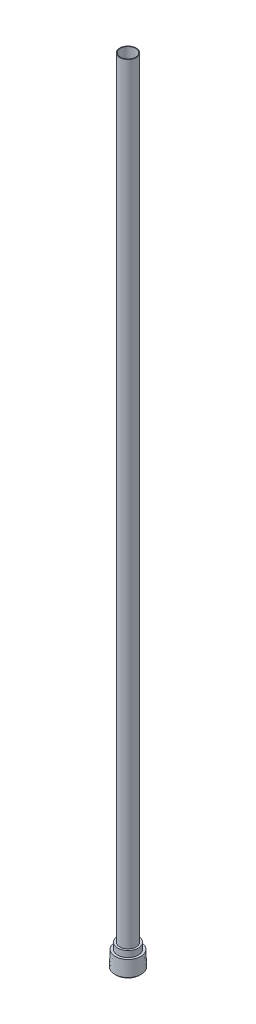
ISO-10303-21;
HEADER;
FILE_DESCRIPTION(('STEP AP214'),'2;1');
FILE_NAME('part.step','',(''),(''),'','','');
FILE_SCHEMA(('AUTOMOTIVE_DESIGN { 1 0 10303 214 1 1 1 1 }'));
ENDSEC;
DATA;
#1=APPLICATION_CONTEXT('core data for automotive mechanical design processes');
#2=APPLICATION_PROTOCOL_DEFINITION('international standard','automotive_design',2000,#1);
#3=PRODUCT_CONTEXT('',#1,'mechanical');
#4=PRODUCT('Part','Part','',(#3));
#5=PRODUCT_RELATED_PRODUCT_CATEGORY('part','',(#4));
#6=PRODUCT_DEFINITION_FORMATION('','',#4);
#7=PRODUCT_DEFINITION_CONTEXT('part definition',#1,'design');
#8=PRODUCT_DEFINITION('design','',#6,#7);
#9=PRODUCT_DEFINITION_SHAPE('','',#8);
#10=(LENGTH_UNIT() NAMED_UNIT(*) SI_UNIT(.MILLI.,.METRE.));
#11=(NAMED_UNIT(*) PLANE_ANGLE_UNIT() SI_UNIT($,.RADIAN.));
#12=(NAMED_UNIT(*) SI_UNIT($,.STERADIAN.) SOLID_ANGLE_UNIT());
#13=UNCERTAINTY_MEASURE_WITH_UNIT(LENGTH_MEASURE(1.E-05),#10,'distance_accuracy_value','');
#14=(GEOMETRIC_REPRESENTATION_CONTEXT(3) GLOBAL_UNCERTAINTY_ASSIGNED_CONTEXT((#13)) GLOBAL_UNIT_ASSIGNED_CONTEXT((#10,
#11,#12)) REPRESENTATION_CONTEXT('',''));
#15=CARTESIAN_POINT('',(0.,0.,0.));
#16=DIRECTION('',(0.,0.,1.));
#17=DIRECTION('',(1.,0.,0.));
#18=AXIS2_PLACEMENT_3D('',#15,#16,#17);
#19=CARTESIAN_POINT('',(0.,0.,0.));
#20=DIRECTION('',(0.,1.,0.));
#21=DIRECTION('',(0.,0.,1.));
#22=AXIS2_PLACEMENT_3D('',#19,#20,#21);
#23=PLANE('',#22);
#24=CARTESIAN_POINT('',(0.,0.,0.));
#25=DIRECTION('',(0.,1.,0.));
#26=DIRECTION('',(0.,0.,1.));
#27=AXIS2_PLACEMENT_3D('',#24,#25,#26);
#28=CIRCLE('',#27,4.58469999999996);
#29=CARTESIAN_POINT('',(0.,0.,4.58469999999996));
#30=VERTEX_POINT('',#29);
#31=EDGE_CURVE('E11',#30,#30,#28,.F.);
#32=ORIENTED_EDGE('',*,*,#31,.T.);
#33=EDGE_LOOP('',(#32));
#34=FACE_BOUND('',#33,.T.);
#35=DIRECTION('',(-0.866025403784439,0.,-0.5));
#36=VECTOR('',#35,1.);
#37=CARTESIAN_POINT('',(0.,0.,2.74229830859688));
#38=LINE('',#37,#36);
#39=CARTESIAN_POINT('',(0.,0.,2.74229830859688));
#40=VERTEX_POINT('',#39);
#41=CARTESIAN_POINT('',(-2.3749,0.,1.37114915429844));
#42=VERTEX_POINT('',#41);
#43=EDGE_CURVE('E210',#40,#42,#38,.T.);
#44=ORIENTED_EDGE('',*,*,#43,.F.);
#45=DIRECTION('',(-0.866025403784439,0.,0.5));
#46=VECTOR('',#45,1.);
#47=CARTESIAN_POINT('',(2.3749,0.,1.37114915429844));
#48=LINE('',#47,#46);
#49=CARTESIAN_POINT('',(2.3749,0.,1.37114915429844));
#50=VERTEX_POINT('',#49);
#51=EDGE_CURVE('E50',#50,#40,#48,.T.);
#52=ORIENTED_EDGE('',*,*,#51,.F.);
#53=DIRECTION('',(0.,0.,1.));
#54=VECTOR('',#53,1.);
#55=CARTESIAN_POINT('',(2.3749,0.,-1.37114915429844));
#56=LINE('',#55,#54);
#57=CARTESIAN_POINT('',(2.3749,0.,-1.37114915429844));
#58=VERTEX_POINT('',#57);
#59=EDGE_CURVE('E84',#58,#50,#56,.T.);
#60=ORIENTED_EDGE('',*,*,#59,.F.);
#61=DIRECTION('',(0.866025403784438,0.,0.5));
#62=VECTOR('',#61,1.);
#63=CARTESIAN_POINT('',(0.,0.,-2.74229830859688));
#64=LINE('',#63,#62);
#65=CARTESIAN_POINT('',(0.,0.,-2.74229830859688));
#66=VERTEX_POINT('',#65);
#67=EDGE_CURVE('E93',#66,#58,#64,.T.);
#68=ORIENTED_EDGE('',*,*,#67,.F.);
#69=DIRECTION('',(0.866025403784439,0.,-0.5));
#70=VECTOR('',#69,1.);
#71=CARTESIAN_POINT('',(-2.3749,0.,-1.37114915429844));
#72=LINE('',#71,#70);
#73=CARTESIAN_POINT('',(-2.3749,0.,-1.37114915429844));
#74=VERTEX_POINT('',#73);
#75=EDGE_CURVE('E99',#74,#66,#72,.T.);
#76=ORIENTED_EDGE('',*,*,#75,.F.);
#77=DIRECTION('',(0.,0.,-1.));
#78=VECTOR('',#77,1.);
#79=CARTESIAN_POINT('',(-2.3749,0.,1.37114915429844));
#80=LINE('',#79,#78);
#81=EDGE_CURVE('E224',#42,#74,#80,.T.);
#82=ORIENTED_EDGE('',*,*,#81,.F.);
#83=EDGE_LOOP('',(#44,#52,#60,#68,#76,#82));
#84=FACE_BOUND('',#83,.T.);
#85=ADVANCED_FACE('F34',(#34,#84),#23,.F.);
#86=CARTESIAN_POINT('',(0.,0.,0.));
#87=DIRECTION('',(0.,-1.,0.));
#88=DIRECTION('',(0.,0.,-1.));
#89=AXIS2_PLACEMENT_3D('',#86,#87,#88);
#90=CONICAL_SURFACE('',#89,5.0927,0.0364424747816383);
#91=CARTESIAN_POINT('',(0.,0.490130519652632,0.));
#92=DIRECTION('',(0.,1.,0.));
#93=DIRECTION('',(0.,0.,1.));
#94=AXIS2_PLACEMENT_3D('',#91,#92,#93);
#95=CIRCLE('',#94,5.07483051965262);
#96=CARTESIAN_POINT('',(0.,0.490130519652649,5.07483051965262));
#97=VERTEX_POINT('',#96);
#98=EDGE_CURVE('E43',#97,#97,#95,.T.);
#99=ORIENTED_EDGE('',*,*,#98,.T.);
#100=EDGE_LOOP('',(#99));
#101=FACE_BOUND('',#100,.T.);
#102=CARTESIAN_POINT('',(0.,6.35000000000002,0.));
#103=DIRECTION('',(0.,1.,0.));
#104=DIRECTION('',(0.,0.,1.));
#105=AXIS2_PLACEMENT_3D('',#102,#103,#104);
#106=CIRCLE('',#105,4.86118778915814);
#107=CARTESIAN_POINT('',(0.,6.35000000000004,4.86118778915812));
#108=VERTEX_POINT('',#107);
#109=EDGE_CURVE('E127',#108,#108,#106,.T.);
#110=ORIENTED_EDGE('',*,*,#109,.F.);
#111=EDGE_LOOP('',(#110));
#112=FACE_BOUND('',#111,.T.);
#113=ADVANCED_FACE('F132',(#101,#112),#90,.T.);
#114=CARTESIAN_POINT('',(0.,6.35,-4.86118778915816));
#115=DIRECTION('',(0.,-1.,0.));
#116=DIRECTION('',(0.,0.,-1.));
#117=AXIS2_PLACEMENT_3D('',#114,#115,#116);
#118=PLANE('',#117);
#119=CARTESIAN_POINT('',(0.,6.35000000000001,0.));
#120=DIRECTION('',(0.,1.,0.));
#121=DIRECTION('',(0.,0.,1.));
#122=AXIS2_PLACEMENT_3D('',#119,#120,#121);
#123=CIRCLE('',#122,3.96239999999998);
#124=CARTESIAN_POINT('',(0.,6.35000000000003,3.96239999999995));
#125=VERTEX_POINT('',#124);
#126=EDGE_CURVE('E124',#125,#125,#123,.T.);
#127=ORIENTED_EDGE('',*,*,#126,.F.);
#128=EDGE_LOOP('',(#127));
#129=FACE_BOUND('',#128,.T.);
#130=ORIENTED_EDGE('',*,*,#109,.T.);
#131=EDGE_LOOP('',(#130));
#132=FACE_BOUND('',#131,.T.);
#133=ADVANCED_FACE('F150',(#129,#132),#118,.F.);
#134=CARTESIAN_POINT('',(0.,0.,0.));
#135=DIRECTION('',(0.,1.,0.));
#136=DIRECTION('',(0.,0.,1.));
#137=AXIS2_PLACEMENT_3D('',#134,#135,#136);
#138=CYLINDRICAL_SURFACE('',#137,3.96239999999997);
#139=CARTESIAN_POINT('',(0.,8.71220000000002,0.));
#140=DIRECTION('',(0.,1.,0.));
#141=DIRECTION('',(0.,0.,1.));
#142=AXIS2_PLACEMENT_3D('',#139,#140,#141);
#143=CIRCLE('',#142,3.96239999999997);
#144=CARTESIAN_POINT('',(0.,8.71220000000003,3.96239999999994));
#145=VERTEX_POINT('',#144);
#146=EDGE_CURVE('E121',#145,#145,#143,.T.);
#147=ORIENTED_EDGE('',*,*,#146,.F.);
#148=EDGE_LOOP('',(#147));
#149=FACE_BOUND('',#148,.T.);
#150=ORIENTED_EDGE('',*,*,#126,.T.);
#151=EDGE_LOOP('',(#150));
#152=FACE_BOUND('',#151,.T.);
#153=ADVANCED_FACE('F155',(#149,#152),#138,.T.);
#154=CARTESIAN_POINT('',(0.,8.7122,-3.9624));
#155=DIRECTION('',(0.,-1.,0.));
#156=DIRECTION('',(0.,0.,-1.));
#157=AXIS2_PLACEMENT_3D('',#154,#155,#156);
#158=PLANE('',#157);
#159=CARTESIAN_POINT('',(0.,8.71220000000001,0.));
#160=DIRECTION('',(0.,1.,0.));
#161=DIRECTION('',(0.,0.,1.));
#162=AXIS2_PLACEMENT_3D('',#159,#160,#161);
#163=CIRCLE('',#162,3.17499999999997);
#164=CARTESIAN_POINT('',(0.,8.71220000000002,3.17499999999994));
#165=VERTEX_POINT('',#164);
#166=EDGE_CURVE('E118',#165,#165,#163,.T.);
#167=ORIENTED_EDGE('',*,*,#166,.F.);
#168=EDGE_LOOP('',(#167));
#169=FACE_BOUND('',#168,.T.);
#170=ORIENTED_EDGE('',*,*,#146,.T.);
#171=EDGE_LOOP('',(#170));
#172=FACE_BOUND('',#171,.T.);
#173=ADVANCED_FACE('F159',(#169,#172),#158,.F.);
#174=CARTESIAN_POINT('',(0.,0.,0.));
#175=DIRECTION('',(0.,1.,0.));
#176=DIRECTION('',(0.,0.,1.));
#177=AXIS2_PLACEMENT_3D('',#174,#175,#176);
#178=CYLINDRICAL_SURFACE('',#177,3.17499999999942);
#179=CARTESIAN_POINT('',(0.,304.8,-1.06420362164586E-12));
#180=DIRECTION('',(0.,1.,0.));
#181=DIRECTION('',(0.,0.,1.));
#182=AXIS2_PLACEMENT_3D('',#179,#180,#181);
#183=CIRCLE('',#182,3.17499999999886);
#184=CARTESIAN_POINT('',(0.,304.8,3.1749999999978));
#185=VERTEX_POINT('',#184);
#186=EDGE_CURVE('E107',#185,#185,#183,.T.);
#187=ORIENTED_EDGE('',*,*,#186,.F.);
#188=EDGE_LOOP('',(#187));
#189=FACE_BOUND('',#188,.T.);
#190=ORIENTED_EDGE('',*,*,#166,.T.);
#191=EDGE_LOOP('',(#190));
#192=FACE_BOUND('',#191,.T.);
#193=ADVANCED_FACE('F163',(#189,#192),#178,.T.);
#194=CARTESIAN_POINT('',(0.,304.8,-3.17499999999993));
#195=DIRECTION('',(0.,-1.,0.));
#196=DIRECTION('',(0.,0.,-1.));
#197=AXIS2_PLACEMENT_3D('',#194,#195,#196);
#198=PLANE('',#197);
#199=CARTESIAN_POINT('',(0.,304.8,-1.06420362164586E-12));
#200=DIRECTION('',(0.,1.,0.));
#201=DIRECTION('',(0.,0.,1.));
#202=AXIS2_PLACEMENT_3D('',#199,#200,#201);
#203=CIRCLE('',#202,2.921);
#204=CARTESIAN_POINT('',(0.,304.8,2.92099999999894));
#205=VERTEX_POINT('',#204);
#206=EDGE_CURVE('E228',#205,#205,#203,.T.);
#207=ORIENTED_EDGE('',*,*,#206,.F.);
#208=EDGE_LOOP('',(#207));
#209=FACE_BOUND('',#208,.T.);
#210=ORIENTED_EDGE('',*,*,#186,.T.);
#211=EDGE_LOOP('',(#210));
#212=FACE_BOUND('',#211,.T.);
#213=ADVANCED_FACE('F167',(#209,#212),#198,.F.);
#214=CARTESIAN_POINT('',(2.3749,4.74980000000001,1.37114915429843));
#215=DIRECTION('',(0.5,0.,0.866025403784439));
#216=DIRECTION('',(0.866025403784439,0.,-0.5));
#217=AXIS2_PLACEMENT_3D('',#214,#215,#216);
#218=PLANE('',#217);
#219=ORIENTED_EDGE('',*,*,#51,.T.);
#220=DIRECTION('',(0.,-1.,0.));
#221=VECTOR('',#220,1.);
#222=CARTESIAN_POINT('',(0.,4.74980000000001,2.74229830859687));
#223=LINE('',#222,#221);
#224=CARTESIAN_POINT('',(0.,4.74980000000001,2.74229830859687));
#225=VERTEX_POINT('',#224);
#226=EDGE_CURVE('E114',#225,#40,#223,.T.);
#227=ORIENTED_EDGE('',*,*,#226,.F.);
#228=DIRECTION('',(-0.866025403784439,0.,0.5));
#229=VECTOR('',#228,1.);
#230=CARTESIAN_POINT('',(2.3749,4.74980000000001,1.37114915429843));
#231=LINE('',#230,#229);
#232=CARTESIAN_POINT('',(2.3749,4.7498,1.37114915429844));
#233=VERTEX_POINT('',#232);
#234=EDGE_CURVE('E59',#233,#225,#231,.T.);
#235=ORIENTED_EDGE('',*,*,#234,.F.);
#236=DIRECTION('',(0.,-1.,0.));
#237=VECTOR('',#236,1.);
#238=CARTESIAN_POINT('',(2.3749,4.74980000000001,1.37114915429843));
#239=LINE('',#238,#237);
#240=EDGE_CURVE('E89',#233,#50,#239,.T.);
#241=ORIENTED_EDGE('',*,*,#240,.T.);
#242=EDGE_LOOP('',(#219,#227,#235,#241));
#243=FACE_BOUND('',#242,.T.);
#244=ADVANCED_FACE('F171',(#243),#218,.F.);
#245=CARTESIAN_POINT('',(2.3749,4.7498,-1.37114915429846));
#246=DIRECTION('',(1.,0.,0.));
#247=DIRECTION('',(0.,0.,-1.));
#248=AXIS2_PLACEMENT_3D('',#245,#246,#247);
#249=PLANE('',#248);
#250=ORIENTED_EDGE('',*,*,#59,.T.);
#251=ORIENTED_EDGE('',*,*,#240,.F.);
#252=DIRECTION('',(0.,0.,1.));
#253=VECTOR('',#252,1.);
#254=CARTESIAN_POINT('',(2.3749,4.7498,-1.37114915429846));
#255=LINE('',#254,#253);
#256=CARTESIAN_POINT('',(2.3749,4.7498,-1.37114915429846));
#257=VERTEX_POINT('',#256);
#258=EDGE_CURVE('E86',#257,#233,#255,.T.);
#259=ORIENTED_EDGE('',*,*,#258,.F.);
#260=DIRECTION('',(0.,-1.,0.));
#261=VECTOR('',#260,1.);
#262=CARTESIAN_POINT('',(2.3749,4.7498,-1.37114915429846));
#263=LINE('',#262,#261);
#264=EDGE_CURVE('E79',#257,#58,#263,.T.);
#265=ORIENTED_EDGE('',*,*,#264,.T.);
#266=EDGE_LOOP('',(#250,#251,#259,#265));
#267=FACE_BOUND('',#266,.T.);
#268=ADVANCED_FACE('F81',(#267),#249,.F.);
#269=CARTESIAN_POINT('',(0.,4.74979999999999,-2.7422983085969));
#270=DIRECTION('',(0.5,0.,-0.866025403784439));
#271=DIRECTION('',(-0.866025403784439,0.,-0.5));
#272=AXIS2_PLACEMENT_3D('',#269,#270,#271);
#273=PLANE('',#272);
#274=ORIENTED_EDGE('',*,*,#67,.T.);
#275=ORIENTED_EDGE('',*,*,#264,.F.);
#276=DIRECTION('',(0.866025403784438,0.,0.5));
#277=VECTOR('',#276,1.);
#278=CARTESIAN_POINT('',(0.,4.74979999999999,-2.7422983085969));
#279=LINE('',#278,#277);
#280=CARTESIAN_POINT('',(0.,4.74979999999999,-2.7422983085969));
#281=VERTEX_POINT('',#280);
#282=EDGE_CURVE('E216',#281,#257,#279,.T.);
#283=ORIENTED_EDGE('',*,*,#282,.F.);
#284=DIRECTION('',(0.,-1.,0.));
#285=VECTOR('',#284,1.);
#286=CARTESIAN_POINT('',(0.,4.74979999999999,-2.7422983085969));
#287=LINE('',#286,#285);
#288=EDGE_CURVE('E90',#281,#66,#287,.T.);
#289=ORIENTED_EDGE('',*,*,#288,.T.);
#290=EDGE_LOOP('',(#274,#275,#283,#289));
#291=FACE_BOUND('',#290,.T.);
#292=ADVANCED_FACE('F94',(#291),#273,.F.);
#293=CARTESIAN_POINT('',(-2.3749,4.7498,-1.37114915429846));
#294=DIRECTION('',(-0.5,0.,-0.866025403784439));
#295=DIRECTION('',(-0.866025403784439,0.,0.5));
#296=AXIS2_PLACEMENT_3D('',#293,#294,#295);
#297=PLANE('',#296);
#298=ORIENTED_EDGE('',*,*,#75,.T.);
#299=ORIENTED_EDGE('',*,*,#288,.F.);
#300=DIRECTION('',(0.866025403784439,0.,-0.5));
#301=VECTOR('',#300,1.);
#302=CARTESIAN_POINT('',(-2.3749,4.7498,-1.37114915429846));
#303=LINE('',#302,#301);
#304=CARTESIAN_POINT('',(-2.3749,4.7498,-1.37114915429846));
#305=VERTEX_POINT('',#304);
#306=EDGE_CURVE('E214',#305,#281,#303,.T.);
#307=ORIENTED_EDGE('',*,*,#306,.F.);
#308=DIRECTION('',(0.,-1.,0.));
#309=VECTOR('',#308,1.);
#310=CARTESIAN_POINT('',(-2.3749,4.7498,-1.37114915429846));
#311=LINE('',#310,#309);
#312=EDGE_CURVE('E110',#305,#74,#311,.T.);
#313=ORIENTED_EDGE('',*,*,#312,.T.);
#314=EDGE_LOOP('',(#298,#299,#307,#313));
#315=FACE_BOUND('',#314,.T.);
#316=ADVANCED_FACE('F182',(#315),#297,.F.);
#317=CARTESIAN_POINT('',(-2.3749,4.74980000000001,1.37114915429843));
#318=DIRECTION('',(-1.,0.,0.));
#319=DIRECTION('',(0.,0.,1.));
#320=AXIS2_PLACEMENT_3D('',#317,#318,#319);
#321=PLANE('',#320);
#322=ORIENTED_EDGE('',*,*,#81,.T.);
#323=ORIENTED_EDGE('',*,*,#312,.F.);
#324=DIRECTION('',(0.,0.,-1.));
#325=VECTOR('',#324,1.);
#326=CARTESIAN_POINT('',(-2.3749,4.74980000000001,1.37114915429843));
#327=LINE('',#326,#325);
#328=CARTESIAN_POINT('',(-2.3749,4.7498,1.37114915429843));
#329=VERTEX_POINT('',#328);
#330=EDGE_CURVE('E205',#329,#305,#327,.T.);
#331=ORIENTED_EDGE('',*,*,#330,.F.);
#332=DIRECTION('',(0.,-1.,0.));
#333=VECTOR('',#332,1.);
#334=CARTESIAN_POINT('',(-2.3749,4.74980000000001,1.37114915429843));
#335=LINE('',#334,#333);
#336=EDGE_CURVE('E112',#329,#42,#335,.T.);
#337=ORIENTED_EDGE('',*,*,#336,.T.);
#338=EDGE_LOOP('',(#322,#323,#331,#337));
#339=FACE_BOUND('',#338,.T.);
#340=ADVANCED_FACE('F178',(#339),#321,.F.);
#341=CARTESIAN_POINT('',(0.,4.74980000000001,2.74229830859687));
#342=DIRECTION('',(-0.5,0.,0.866025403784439));
#343=DIRECTION('',(0.866025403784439,0.,0.5));
#344=AXIS2_PLACEMENT_3D('',#341,#342,#343);
#345=PLANE('',#344);
#346=ORIENTED_EDGE('',*,*,#43,.T.);
#347=ORIENTED_EDGE('',*,*,#336,.F.);
#348=DIRECTION('',(-0.866025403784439,0.,-0.5));
#349=VECTOR('',#348,1.);
#350=CARTESIAN_POINT('',(0.,4.74980000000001,2.74229830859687));
#351=LINE('',#350,#349);
#352=EDGE_CURVE('E103',#225,#329,#351,.T.);
#353=ORIENTED_EDGE('',*,*,#352,.F.);
#354=ORIENTED_EDGE('',*,*,#226,.T.);
#355=EDGE_LOOP('',(#346,#347,#353,#354));
#356=FACE_BOUND('',#355,.T.);
#357=ADVANCED_FACE('F175',(#356),#345,.F.);
#358=CARTESIAN_POINT('',(0.,4.74980000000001,2.74229830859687));
#359=DIRECTION('',(0.,-1.,0.));
#360=DIRECTION('',(0.,0.,-1.));
#361=AXIS2_PLACEMENT_3D('',#358,#359,#360);
#362=PLANE('',#361);
#363=CARTESIAN_POINT('',(0.,4.7498,0.));
#364=DIRECTION('',(0.,-1.,0.));
#365=DIRECTION('',(0.,0.,-1.));
#366=AXIS2_PLACEMENT_3D('',#363,#364,#365);
#367=CIRCLE('',#366,2.921);
#368=CARTESIAN_POINT('',(0.,4.74979999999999,-2.92100000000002));
#369=VERTEX_POINT('',#368);
#370=EDGE_CURVE('E197',#369,#369,#367,.F.);
#371=ORIENTED_EDGE('',*,*,#370,.T.);
#372=EDGE_LOOP('',(#371));
#373=FACE_BOUND('',#372,.T.);
#374=ORIENTED_EDGE('',*,*,#352,.T.);
#375=ORIENTED_EDGE('',*,*,#330,.T.);
#376=ORIENTED_EDGE('',*,*,#306,.T.);
#377=ORIENTED_EDGE('',*,*,#282,.T.);
#378=ORIENTED_EDGE('',*,*,#258,.T.);
#379=ORIENTED_EDGE('',*,*,#234,.T.);
#380=EDGE_LOOP('',(#374,#375,#376,#377,#378,#379));
#381=FACE_BOUND('',#380,.T.);
#382=ADVANCED_FACE('F141',(#373,#381),#362,.F.);
#383=CARTESIAN_POINT('',(0.,-3.51203563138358,0.));
#384=DIRECTION('',(0.,1.,0.));
#385=DIRECTION('',(0.,0.,1.));
#386=AXIS2_PLACEMENT_3D('',#383,#384,#385);
#387=CYLINDRICAL_SURFACE('',#386,2.921);
#388=ORIENTED_EDGE('',*,*,#206,.T.);
#389=EDGE_LOOP('',(#388));
#390=FACE_BOUND('',#389,.T.);
#391=ORIENTED_EDGE('',*,*,#370,.F.);
#392=EDGE_LOOP('',(#391));
#393=FACE_BOUND('',#392,.T.);
#394=ADVANCED_FACE('F136',(#390,#393),#387,.F.);
#395=CARTESIAN_POINT('',(0.,0.490130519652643,0.));
#396=DIRECTION('',(0.,1.,0.));
#397=DIRECTION('',(0.,0.,1.));
#398=AXIS2_PLACEMENT_3D('',#395,#396,#397);
#399=CONICAL_SURFACE('',#398,5.07483051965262,0.785398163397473);
#400=ORIENTED_EDGE('',*,*,#31,.F.);
#401=EDGE_LOOP('',(#400));
#402=FACE_BOUND('',#401,.T.);
#403=ORIENTED_EDGE('',*,*,#98,.F.);
#404=EDGE_LOOP('',(#403));
#405=FACE_BOUND('',#404,.T.);
#406=ADVANCED_FACE('F37',(#402,#405),#399,.T.);
#407=CLOSED_SHELL('',(#85,#113,#133,#153,#173,#193,#213,#244,#268,#292,#316,#340,#357,#382,#394,#406));
#408=MANIFOLD_SOLID_BREP('B2',#407);
#409=ADVANCED_BREP_SHAPE_REPRESENTATION('',(#18,#408),#14);
#410=SHAPE_DEFINITION_REPRESENTATION(#9,#409);
ENDSEC;
END-ISO-10303-21;
